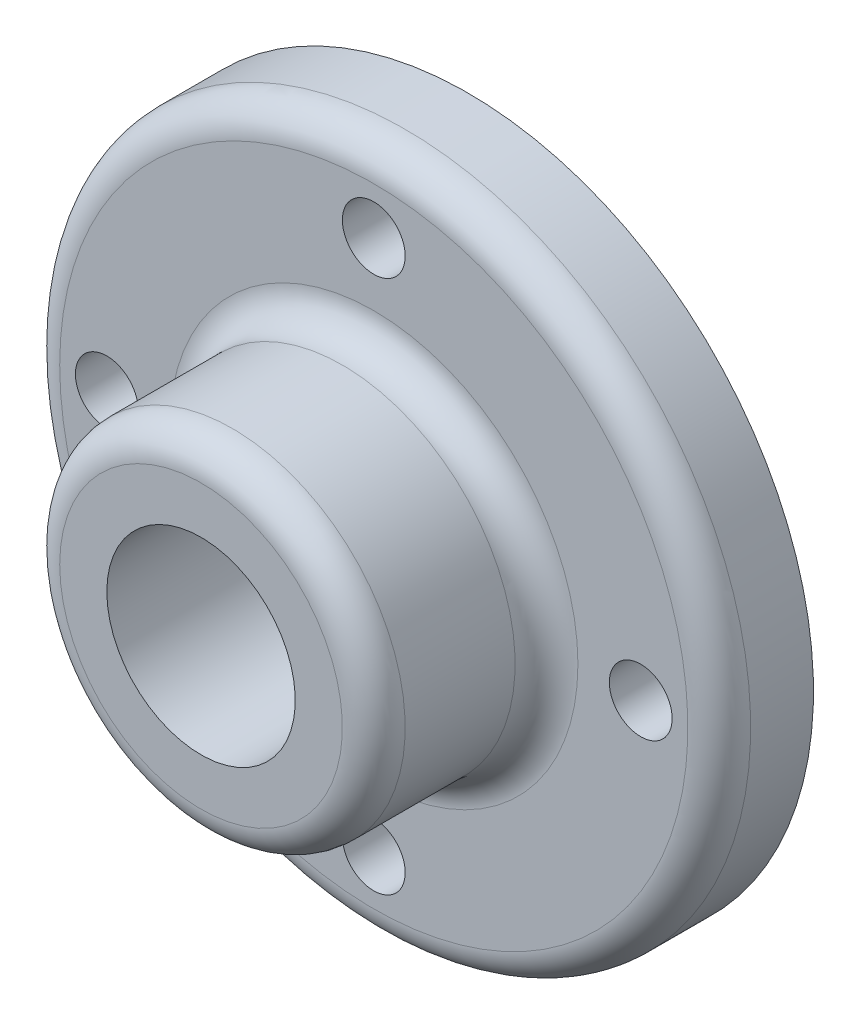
from build123d import *

# Parameters (mm, degrees)
FILLET1_R          = 6.35
SKETCH2_R          = 6.35
CUT_EXTRUDE1_DEPTH = 113.567071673
CIRPATTERN1_COUNT  = 4


with BuildPart() as part:
    # Sketch1 → Base-Revolve (revolve)
    with BuildSketch(Plane(origin=(0, 0, 0), x_dir=(1, 0, 0), z_dir=(0, 1, 0)), mode=Mode.PRIVATE) as base_revolve_sk:
        Polygon((19.05, 0), (19.05, -53.975), (34.925, -53.975), (34.925, -19.05), (69.85, -19.05), (69.85, 0), align=None)
    revolve(base_revolve_sk.sketch.rotate(Axis((0, 0, 0), (0, 0, 1)), 180), axis=Axis((0, 0, 0), (0, 0, 1)))

    # Fillet1
    fillet1_edges = [part.edges().sort_by_distance(p)[0] for p in [
        (69.85, 0, 19.05),
        (34.925, 0, 19.05),
        (34.925, 0, 53.975),
    ]]
    fillet(fillet1_edges, radius=FILLET1_R)

    # Sketch2 → Cut-Extrude1 (cut, through all)
    with BuildSketch(Plane(origin=(0, 0, 0), x_dir=(-1, 0, 0), z_dir=(0, 0, -1))):
        with Locations((-53.975, 0)):
            Circle(SKETCH2_R)
    cut_extrude1 = extrude(amount=-CUT_EXTRUDE1_DEPTH, mode=Mode.SUBTRACT)

    # CirPattern1: Cut-Extrude1 ×4 about axis
    cirpattern1_axis = Axis((0, 0, 0), (0, 0, 1))
    for i in range(1, CIRPATTERN1_COUNT):
        add(cut_extrude1.rotate(cirpattern1_axis, i * 360 / CIRPATTERN1_COUNT), mode=Mode.SUBTRACT)


solid = part.part
